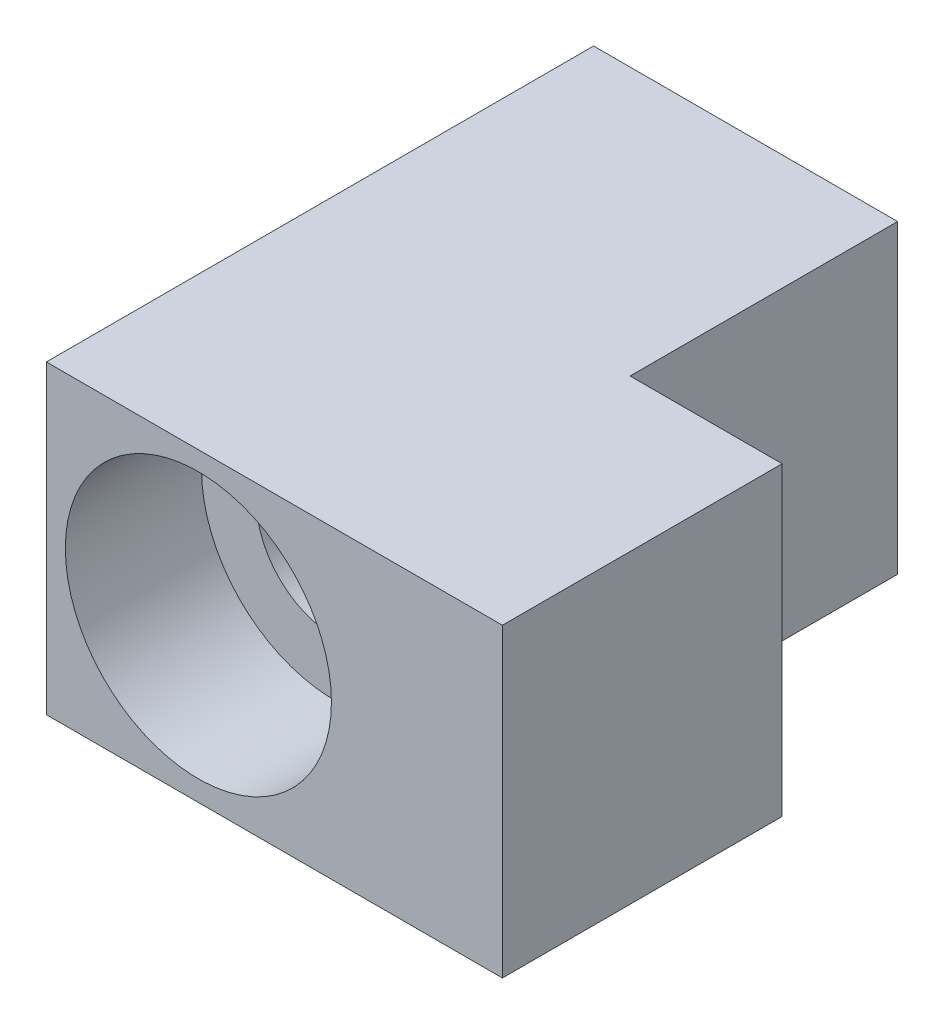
from build123d import *

# Parameters (mm, degrees)
SKETCH1_W                                      = 6.35
SKETCH1_H                                      = 6.381127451
BOSS_EXTRUDE1_DEPTH                            = 11.43
SKETCH2_W                                      = 5.842
SKETCH2_H                                      = 6.381127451
BOSS_EXTRUDE2_DEPTH                            = 3.175
CBORE_FOR_4_SOCKET_HEAD_CAP_SCREW1_D           = 3.2639
CBORE_FOR_4_SOCKET_HEAD_CAP_SCREW1_CBORE_D     = 5.55752
CBORE_FOR_4_SOCKET_HEAD_CAP_SCREW1_CBORE_DEPTH = 2.8448


with BuildPart() as part:
    # Sketch1 → Boss-Extrude1 (new body)
    with BuildSketch(Plane.XY):
        with Locations((3.175, 3.190563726)):
            Rectangle(SKETCH1_W, SKETCH1_H)
    extrude(amount=BOSS_EXTRUDE1_DEPTH)

    # Sketch2 → Boss-Extrude2 (add)
    with BuildSketch(Plane(origin=(6.35, 0, 0), x_dir=(0, 0, -1), z_dir=(1, 0, 0))):
        with Locations((-8.509, 3.190563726)):
            Rectangle(SKETCH2_W, SKETCH2_H)
    extrude(amount=BOSS_EXTRUDE2_DEPTH)

    # CBORE for _4 Socket Head Cap Screw1 (through all)
    with Locations(Plane.XY.offset(11.43)):
        with Locations((3.175, 3.206127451)):
            CounterBoreHole(CBORE_FOR_4_SOCKET_HEAD_CAP_SCREW1_D / 2, CBORE_FOR_4_SOCKET_HEAD_CAP_SCREW1_CBORE_D / 2, CBORE_FOR_4_SOCKET_HEAD_CAP_SCREW1_CBORE_DEPTH)


solid = part.part
